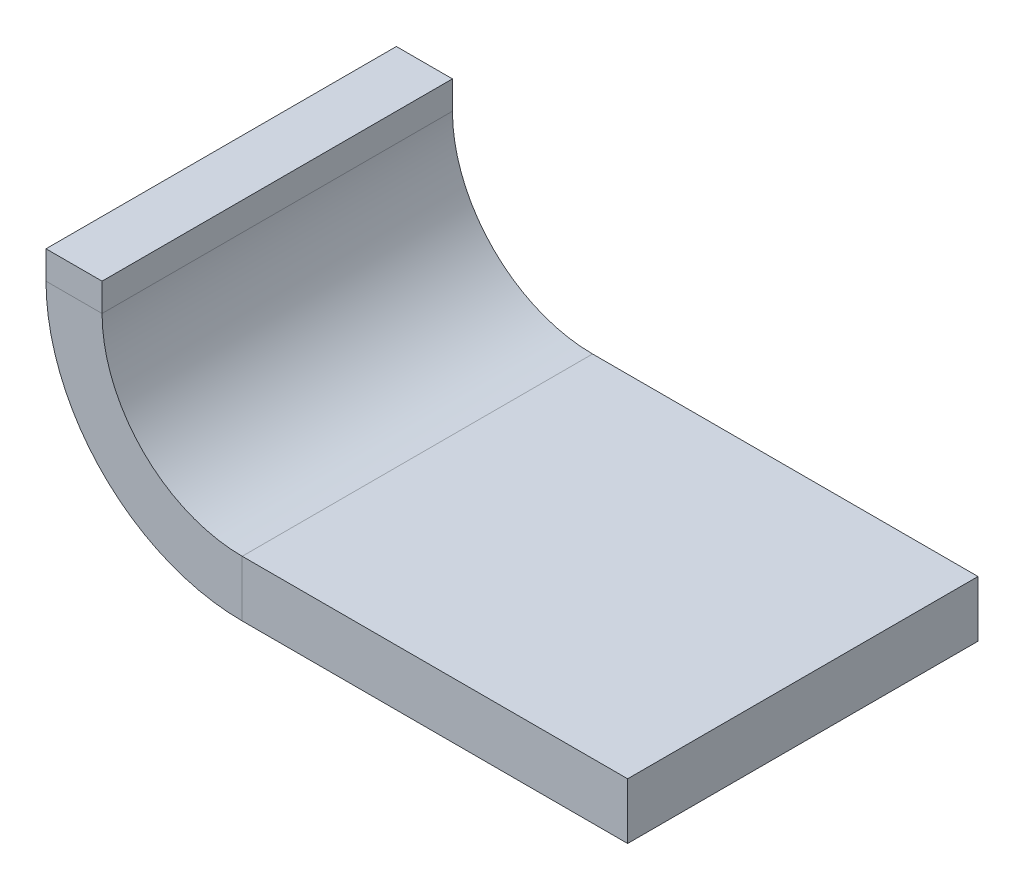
ISO-10303-21;
HEADER;
FILE_DESCRIPTION(('STEP AP214'),'2;1');
FILE_NAME('part.step','',(''),(''),'','','');
FILE_SCHEMA(('AUTOMOTIVE_DESIGN { 1 0 10303 214 1 1 1 1 }'));
ENDSEC;
DATA;
#1=APPLICATION_CONTEXT('core data for automotive mechanical design processes');
#2=APPLICATION_PROTOCOL_DEFINITION('international standard','automotive_design',2000,#1);
#3=PRODUCT_CONTEXT('',#1,'mechanical');
#4=PRODUCT('Part','Part','',(#3));
#5=PRODUCT_RELATED_PRODUCT_CATEGORY('part','',(#4));
#6=PRODUCT_DEFINITION_FORMATION('','',#4);
#7=PRODUCT_DEFINITION_CONTEXT('part definition',#1,'design');
#8=PRODUCT_DEFINITION('design','',#6,#7);
#9=PRODUCT_DEFINITION_SHAPE('','',#8);
#10=(LENGTH_UNIT() NAMED_UNIT(*) SI_UNIT(.MILLI.,.METRE.));
#11=(NAMED_UNIT(*) PLANE_ANGLE_UNIT() SI_UNIT($,.RADIAN.));
#12=(NAMED_UNIT(*) SI_UNIT($,.STERADIAN.) SOLID_ANGLE_UNIT());
#13=UNCERTAINTY_MEASURE_WITH_UNIT(LENGTH_MEASURE(1.E-05),#10,'distance_accuracy_value','');
#14=(GEOMETRIC_REPRESENTATION_CONTEXT(3) GLOBAL_UNCERTAINTY_ASSIGNED_CONTEXT((#13)) GLOBAL_UNIT_ASSIGNED_CONTEXT((#10,
#11,#12)) REPRESENTATION_CONTEXT('',''));
#15=CARTESIAN_POINT('',(0.,0.,0.));
#16=DIRECTION('',(0.,0.,1.));
#17=DIRECTION('',(1.,0.,0.));
#18=AXIS2_PLACEMENT_3D('',#15,#16,#17);
#19=CARTESIAN_POINT('',(-83.,28.,50.));
#20=DIRECTION('',(0.,0.,1.));
#21=DIRECTION('',(1.,0.,0.));
#22=AXIS2_PLACEMENT_3D('',#19,#20,#21);
#23=PLANE('',#22);
#24=DIRECTION('',(1.,0.,0.));
#25=VECTOR('',#24,1.);
#26=CARTESIAN_POINT('',(-83.,28.,50.));
#27=LINE('',#26,#25);
#28=CARTESIAN_POINT('',(-83.,28.,50.));
#29=VERTEX_POINT('',#28);
#30=CARTESIAN_POINT('',(-75.,28.,50.));
#31=VERTEX_POINT('',#30);
#32=EDGE_CURVE('E11',#29,#31,#27,.T.);
#33=ORIENTED_EDGE('',*,*,#32,.F.);
#34=CARTESIAN_POINT('',(-55.,28.,50.));
#35=DIRECTION('',(0.,0.,-1.));
#36=DIRECTION('',(-1.,0.,0.));
#37=AXIS2_PLACEMENT_3D('',#34,#35,#36);
#38=CIRCLE('',#37,28.);
#39=CARTESIAN_POINT('',(-55.,0.,50.));
#40=VERTEX_POINT('',#39);
#41=EDGE_CURVE('E142',#40,#29,#38,.T.);
#42=ORIENTED_EDGE('',*,*,#41,.F.);
#43=DIRECTION('',(0.,-1.,0.));
#44=VECTOR('',#43,1.);
#45=CARTESIAN_POINT('',(-55.,8.,50.));
#46=LINE('',#45,#44);
#47=CARTESIAN_POINT('',(-55.,8.,50.));
#48=VERTEX_POINT('',#47);
#49=EDGE_CURVE('E39',#48,#40,#46,.T.);
#50=ORIENTED_EDGE('',*,*,#49,.F.);
#51=CARTESIAN_POINT('',(-55.,28.,50.));
#52=DIRECTION('',(0.,0.,1.));
#53=DIRECTION('',(1.,0.,0.));
#54=AXIS2_PLACEMENT_3D('',#51,#52,#53);
#55=CIRCLE('',#54,20.);
#56=EDGE_CURVE('E153',#48,#31,#55,.F.);
#57=ORIENTED_EDGE('',*,*,#56,.T.);
#58=EDGE_LOOP('',(#33,#42,#50,#57));
#59=FACE_BOUND('',#58,.T.);
#60=ADVANCED_FACE('F32',(#59),#23,.T.);
#61=CARTESIAN_POINT('',(-55.,8.,50.));
#62=DIRECTION('',(0.,0.,1.));
#63=DIRECTION('',(1.,0.,0.));
#64=AXIS2_PLACEMENT_3D('',#61,#62,#63);
#65=PLANE('',#64);
#66=DIRECTION('',(0.,1.,0.));
#67=VECTOR('',#66,1.);
#68=CARTESIAN_POINT('',(-83.,28.,50.));
#69=LINE('',#68,#67);
#70=CARTESIAN_POINT('',(-83.,32.,50.));
#71=VERTEX_POINT('',#70);
#72=EDGE_CURVE('E139',#29,#71,#69,.T.);
#73=ORIENTED_EDGE('',*,*,#72,.F.);
#74=ORIENTED_EDGE('',*,*,#32,.T.);
#75=DIRECTION('',(0.,1.,0.));
#76=VECTOR('',#75,1.);
#77=CARTESIAN_POINT('',(-75.,28.,50.));
#78=LINE('',#77,#76);
#79=CARTESIAN_POINT('',(-75.,32.,50.));
#80=VERTEX_POINT('',#79);
#81=EDGE_CURVE('E136',#31,#80,#78,.T.);
#82=ORIENTED_EDGE('',*,*,#81,.T.);
#83=DIRECTION('',(1.,0.,0.));
#84=VECTOR('',#83,1.);
#85=CARTESIAN_POINT('',(-83.,32.,50.));
#86=LINE('',#85,#84);
#87=EDGE_CURVE('E101',#71,#80,#86,.T.);
#88=ORIENTED_EDGE('',*,*,#87,.F.);
#89=EDGE_LOOP('',(#73,#74,#82,#88));
#90=FACE_BOUND('',#89,.T.);
#91=ADVANCED_FACE('F196',(#90),#65,.T.);
#92=CARTESIAN_POINT('',(-55.,0.,0.));
#93=DIRECTION('',(0.,0.,-1.));
#94=DIRECTION('',(-1.,0.,0.));
#95=AXIS2_PLACEMENT_3D('',#92,#93,#94);
#96=PLANE('',#95);
#97=DIRECTION('',(0.,1.,0.));
#98=VECTOR('',#97,1.);
#99=CARTESIAN_POINT('',(-55.,0.,0.));
#100=LINE('',#99,#98);
#101=CARTESIAN_POINT('',(-55.,0.,0.));
#102=VERTEX_POINT('',#101);
#103=CARTESIAN_POINT('',(-55.,8.,0.));
#104=VERTEX_POINT('',#103);
#105=EDGE_CURVE('E171',#102,#104,#100,.T.);
#106=ORIENTED_EDGE('',*,*,#105,.F.);
#107=CARTESIAN_POINT('',(-55.,28.,0.));
#108=DIRECTION('',(0.,0.,-1.));
#109=DIRECTION('',(-1.,0.,0.));
#110=AXIS2_PLACEMENT_3D('',#107,#108,#109);
#111=CIRCLE('',#110,28.);
#112=CARTESIAN_POINT('',(-83.,28.,0.));
#113=VERTEX_POINT('',#112);
#114=EDGE_CURVE('E119',#102,#113,#111,.T.);
#115=ORIENTED_EDGE('',*,*,#114,.T.);
#116=DIRECTION('',(-1.,0.,0.));
#117=VECTOR('',#116,1.);
#118=CARTESIAN_POINT('',(-75.,28.,0.));
#119=LINE('',#118,#117);
#120=CARTESIAN_POINT('',(-75.,28.,0.));
#121=VERTEX_POINT('',#120);
#122=EDGE_CURVE('E104',#121,#113,#119,.T.);
#123=ORIENTED_EDGE('',*,*,#122,.F.);
#124=CARTESIAN_POINT('',(-55.,28.,0.));
#125=DIRECTION('',(0.,0.,1.));
#126=DIRECTION('',(1.,0.,0.));
#127=AXIS2_PLACEMENT_3D('',#124,#125,#126);
#128=CIRCLE('',#127,20.);
#129=EDGE_CURVE('E133',#104,#121,#128,.F.);
#130=ORIENTED_EDGE('',*,*,#129,.F.);
#131=EDGE_LOOP('',(#106,#115,#123,#130));
#132=FACE_BOUND('',#131,.T.);
#133=ADVANCED_FACE('F200',(#132),#96,.T.);
#134=CARTESIAN_POINT('',(-75.,28.,0.));
#135=DIRECTION('',(0.,0.,-1.));
#136=DIRECTION('',(-1.,0.,0.));
#137=AXIS2_PLACEMENT_3D('',#134,#135,#136);
#138=PLANE('',#137);
#139=DIRECTION('',(-1.,0.,0.));
#140=VECTOR('',#139,1.);
#141=CARTESIAN_POINT('',(0.,0.,0.));
#142=LINE('',#141,#140);
#143=CARTESIAN_POINT('',(0.,0.,0.));
#144=VERTEX_POINT('',#143);
#145=EDGE_CURVE('E124',#144,#102,#142,.T.);
#146=ORIENTED_EDGE('',*,*,#145,.T.);
#147=ORIENTED_EDGE('',*,*,#105,.T.);
#148=DIRECTION('',(-1.,0.,0.));
#149=VECTOR('',#148,1.);
#150=CARTESIAN_POINT('',(0.,8.,0.));
#151=LINE('',#150,#149);
#152=CARTESIAN_POINT('',(0.,8.,0.));
#153=VERTEX_POINT('',#152);
#154=EDGE_CURVE('E130',#153,#104,#151,.T.);
#155=ORIENTED_EDGE('',*,*,#154,.F.);
#156=DIRECTION('',(0.,-1.,0.));
#157=VECTOR('',#156,1.);
#158=CARTESIAN_POINT('',(0.,8.,0.));
#159=LINE('',#158,#157);
#160=EDGE_CURVE('E127',#153,#144,#159,.T.);
#161=ORIENTED_EDGE('',*,*,#160,.T.);
#162=EDGE_LOOP('',(#146,#147,#155,#161));
#163=FACE_BOUND('',#162,.T.);
#164=ADVANCED_FACE('F202',(#163),#138,.T.);
#165=CARTESIAN_POINT('',(-75.,28.,50.));
#166=DIRECTION('',(-1.,0.,0.));
#167=DIRECTION('',(0.,0.,1.));
#168=AXIS2_PLACEMENT_3D('',#165,#166,#167);
#169=PLANE('',#168);
#170=DIRECTION('',(0.,1.,0.));
#171=VECTOR('',#170,1.);
#172=CARTESIAN_POINT('',(-75.,28.,0.));
#173=LINE('',#172,#171);
#174=CARTESIAN_POINT('',(-75.,32.,0.));
#175=VERTEX_POINT('',#174);
#176=EDGE_CURVE('E109',#121,#175,#173,.T.);
#177=ORIENTED_EDGE('',*,*,#176,.T.);
#178=DIRECTION('',(0.,0.,-1.));
#179=VECTOR('',#178,1.);
#180=CARTESIAN_POINT('',(-75.,32.,50.));
#181=LINE('',#180,#179);
#182=EDGE_CURVE('E94',#80,#175,#181,.T.);
#183=ORIENTED_EDGE('',*,*,#182,.F.);
#184=ORIENTED_EDGE('',*,*,#81,.F.);
#185=DIRECTION('',(0.,0.,-1.));
#186=VECTOR('',#185,1.);
#187=CARTESIAN_POINT('',(-75.,28.,50.));
#188=LINE('',#187,#186);
#189=EDGE_CURVE('E112',#31,#121,#188,.T.);
#190=ORIENTED_EDGE('',*,*,#189,.T.);
#191=EDGE_LOOP('',(#177,#183,#184,#190));
#192=FACE_BOUND('',#191,.T.);
#193=ADVANCED_FACE('F110',(#192),#169,.F.);
#194=CARTESIAN_POINT('',(-83.,32.,50.));
#195=DIRECTION('',(0.,1.,0.));
#196=DIRECTION('',(0.,0.,1.));
#197=AXIS2_PLACEMENT_3D('',#194,#195,#196);
#198=PLANE('',#197);
#199=DIRECTION('',(1.,0.,0.));
#200=VECTOR('',#199,1.);
#201=CARTESIAN_POINT('',(-83.,32.,0.));
#202=LINE('',#201,#200);
#203=CARTESIAN_POINT('',(-83.,32.,0.));
#204=VERTEX_POINT('',#203);
#205=EDGE_CURVE('E98',#204,#175,#202,.T.);
#206=ORIENTED_EDGE('',*,*,#205,.F.);
#207=DIRECTION('',(0.,0.,-1.));
#208=VECTOR('',#207,1.);
#209=CARTESIAN_POINT('',(-83.,32.,50.));
#210=LINE('',#209,#208);
#211=EDGE_CURVE('E105',#71,#204,#210,.T.);
#212=ORIENTED_EDGE('',*,*,#211,.F.);
#213=ORIENTED_EDGE('',*,*,#87,.T.);
#214=ORIENTED_EDGE('',*,*,#182,.T.);
#215=EDGE_LOOP('',(#206,#212,#213,#214));
#216=FACE_BOUND('',#215,.T.);
#217=ADVANCED_FACE('F96',(#216),#198,.T.);
#218=CARTESIAN_POINT('',(-83.,28.,50.));
#219=DIRECTION('',(-1.,0.,0.));
#220=DIRECTION('',(0.,0.,1.));
#221=AXIS2_PLACEMENT_3D('',#218,#219,#220);
#222=PLANE('',#221);
#223=DIRECTION('',(0.,1.,0.));
#224=VECTOR('',#223,1.);
#225=CARTESIAN_POINT('',(-83.,28.,0.));
#226=LINE('',#225,#224);
#227=EDGE_CURVE('E117',#113,#204,#226,.T.);
#228=ORIENTED_EDGE('',*,*,#227,.F.);
#229=DIRECTION('',(0.,0.,-1.));
#230=VECTOR('',#229,1.);
#231=CARTESIAN_POINT('',(-83.,28.,50.));
#232=LINE('',#231,#230);
#233=EDGE_CURVE('E166',#29,#113,#232,.T.);
#234=ORIENTED_EDGE('',*,*,#233,.F.);
#235=ORIENTED_EDGE('',*,*,#72,.T.);
#236=ORIENTED_EDGE('',*,*,#211,.T.);
#237=EDGE_LOOP('',(#228,#234,#235,#236));
#238=FACE_BOUND('',#237,.T.);
#239=ADVANCED_FACE('F198',(#238),#222,.T.);
#240=CARTESIAN_POINT('',(-55.,28.,50.));
#241=DIRECTION('',(0.,0.,-1.));
#242=DIRECTION('',(-1.,0.,0.));
#243=AXIS2_PLACEMENT_3D('',#240,#241,#242);
#244=CYLINDRICAL_SURFACE('',#243,28.);
#245=ORIENTED_EDGE('',*,*,#114,.F.);
#246=DIRECTION('',(0.,0.,-1.));
#247=VECTOR('',#246,1.);
#248=CARTESIAN_POINT('',(-55.,0.,50.));
#249=LINE('',#248,#247);
#250=EDGE_CURVE('E163',#40,#102,#249,.T.);
#251=ORIENTED_EDGE('',*,*,#250,.F.);
#252=ORIENTED_EDGE('',*,*,#41,.T.);
#253=ORIENTED_EDGE('',*,*,#233,.T.);
#254=EDGE_LOOP('',(#245,#251,#252,#253));
#255=FACE_BOUND('',#254,.T.);
#256=ADVANCED_FACE('F181',(#255),#244,.T.);
#257=CARTESIAN_POINT('',(0.,0.,50.));
#258=DIRECTION('',(0.,-1.,0.));
#259=DIRECTION('',(1.,0.,0.));
#260=AXIS2_PLACEMENT_3D('',#257,#258,#259);
#261=PLANE('',#260);
#262=ORIENTED_EDGE('',*,*,#145,.F.);
#263=DIRECTION('',(0.,0.,-1.));
#264=VECTOR('',#263,1.);
#265=CARTESIAN_POINT('',(0.,0.,50.));
#266=LINE('',#265,#264);
#267=CARTESIAN_POINT('',(0.,0.,50.));
#268=VERTEX_POINT('',#267);
#269=EDGE_CURVE('E161',#268,#144,#266,.T.);
#270=ORIENTED_EDGE('',*,*,#269,.F.);
#271=DIRECTION('',(-1.,0.,0.));
#272=VECTOR('',#271,1.);
#273=CARTESIAN_POINT('',(0.,0.,50.));
#274=LINE('',#273,#272);
#275=EDGE_CURVE('E145',#268,#40,#274,.T.);
#276=ORIENTED_EDGE('',*,*,#275,.T.);
#277=ORIENTED_EDGE('',*,*,#250,.T.);
#278=EDGE_LOOP('',(#262,#270,#276,#277));
#279=FACE_BOUND('',#278,.T.);
#280=ADVANCED_FACE('F185',(#279),#261,.T.);
#281=CARTESIAN_POINT('',(0.,8.,50.));
#282=DIRECTION('',(1.,0.,0.));
#283=DIRECTION('',(0.,1.,0.));
#284=AXIS2_PLACEMENT_3D('',#281,#282,#283);
#285=PLANE('',#284);
#286=ORIENTED_EDGE('',*,*,#160,.F.);
#287=DIRECTION('',(0.,0.,-1.));
#288=VECTOR('',#287,1.);
#289=CARTESIAN_POINT('',(0.,8.,50.));
#290=LINE('',#289,#288);
#291=CARTESIAN_POINT('',(0.,8.,50.));
#292=VERTEX_POINT('',#291);
#293=EDGE_CURVE('E159',#292,#153,#290,.T.);
#294=ORIENTED_EDGE('',*,*,#293,.F.);
#295=DIRECTION('',(0.,-1.,0.));
#296=VECTOR('',#295,1.);
#297=CARTESIAN_POINT('',(0.,8.,50.));
#298=LINE('',#297,#296);
#299=EDGE_CURVE('E148',#292,#268,#298,.T.);
#300=ORIENTED_EDGE('',*,*,#299,.T.);
#301=ORIENTED_EDGE('',*,*,#269,.T.);
#302=EDGE_LOOP('',(#286,#294,#300,#301));
#303=FACE_BOUND('',#302,.T.);
#304=ADVANCED_FACE('F188',(#303),#285,.T.);
#305=CARTESIAN_POINT('',(0.,8.,50.));
#306=DIRECTION('',(0.,-1.,0.));
#307=DIRECTION('',(1.,0.,0.));
#308=AXIS2_PLACEMENT_3D('',#305,#306,#307);
#309=PLANE('',#308);
#310=ORIENTED_EDGE('',*,*,#154,.T.);
#311=DIRECTION('',(0.,0.,-1.));
#312=VECTOR('',#311,1.);
#313=CARTESIAN_POINT('',(-55.,8.,50.));
#314=LINE('',#313,#312);
#315=EDGE_CURVE('E156',#48,#104,#314,.T.);
#316=ORIENTED_EDGE('',*,*,#315,.F.);
#317=DIRECTION('',(-1.,0.,0.));
#318=VECTOR('',#317,1.);
#319=CARTESIAN_POINT('',(0.,8.,50.));
#320=LINE('',#319,#318);
#321=EDGE_CURVE('E151',#292,#48,#320,.T.);
#322=ORIENTED_EDGE('',*,*,#321,.F.);
#323=ORIENTED_EDGE('',*,*,#293,.T.);
#324=EDGE_LOOP('',(#310,#316,#322,#323));
#325=FACE_BOUND('',#324,.T.);
#326=ADVANCED_FACE('F191',(#325),#309,.F.);
#327=CARTESIAN_POINT('',(-55.,28.,50.));
#328=DIRECTION('',(0.,0.,-1.));
#329=DIRECTION('',(-1.,0.,0.));
#330=AXIS2_PLACEMENT_3D('',#327,#328,#329);
#331=CYLINDRICAL_SURFACE('',#330,20.);
#332=ORIENTED_EDGE('',*,*,#129,.T.);
#333=ORIENTED_EDGE('',*,*,#189,.F.);
#334=ORIENTED_EDGE('',*,*,#56,.F.);
#335=ORIENTED_EDGE('',*,*,#315,.T.);
#336=EDGE_LOOP('',(#332,#333,#334,#335));
#337=FACE_BOUND('',#336,.T.);
#338=ADVANCED_FACE('F195',(#337),#331,.F.);
#339=CARTESIAN_POINT('',(-55.,28.,50.));
#340=DIRECTION('',(0.,0.,-1.));
#341=DIRECTION('',(-1.,0.,0.));
#342=AXIS2_PLACEMENT_3D('',#339,#340,#341);
#343=PLANE('',#342);
#344=ORIENTED_EDGE('',*,*,#321,.T.);
#345=ORIENTED_EDGE('',*,*,#49,.T.);
#346=ORIENTED_EDGE('',*,*,#275,.F.);
#347=ORIENTED_EDGE('',*,*,#299,.F.);
#348=EDGE_LOOP('',(#344,#345,#346,#347));
#349=FACE_BOUND('',#348,.T.);
#350=ADVANCED_FACE('F175',(#349),#343,.F.);
#351=CARTESIAN_POINT('',(-55.,28.,0.));
#352=DIRECTION('',(0.,0.,-1.));
#353=DIRECTION('',(-1.,0.,0.));
#354=AXIS2_PLACEMENT_3D('',#351,#352,#353);
#355=PLANE('',#354);
#356=ORIENTED_EDGE('',*,*,#176,.F.);
#357=ORIENTED_EDGE('',*,*,#122,.T.);
#358=ORIENTED_EDGE('',*,*,#227,.T.);
#359=ORIENTED_EDGE('',*,*,#205,.T.);
#360=EDGE_LOOP('',(#356,#357,#358,#359));
#361=FACE_BOUND('',#360,.T.);
#362=ADVANCED_FACE('F115',(#361),#355,.T.);
#363=CLOSED_SHELL('',(#60,#91,#133,#164,#193,#217,#239,#256,#280,#304,#326,#338,#350,#362));
#364=MANIFOLD_SOLID_BREP('B2',#363);
#365=ADVANCED_BREP_SHAPE_REPRESENTATION('',(#18,#364),#14);
#366=SHAPE_DEFINITION_REPRESENTATION(#9,#365);
ENDSEC;
END-ISO-10303-21;
